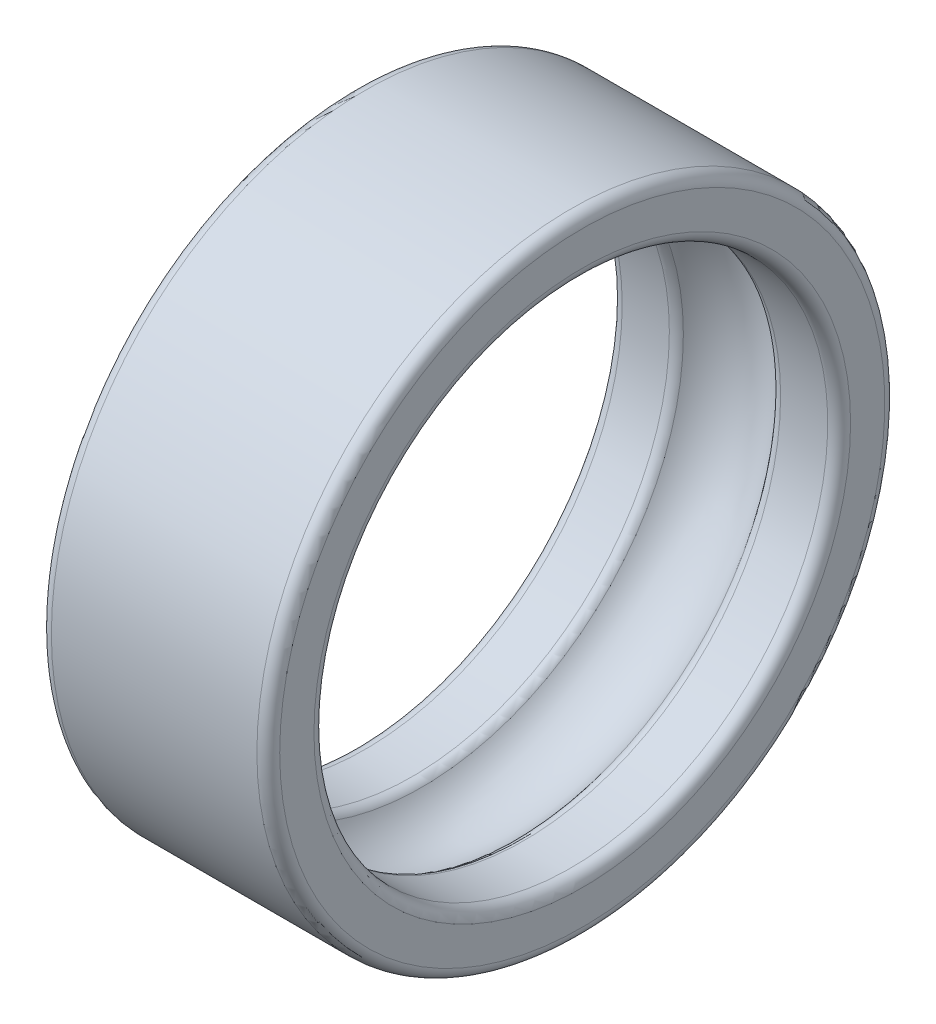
ISO-10303-21;
HEADER;
FILE_DESCRIPTION(('STEP AP214'),'2;1');
FILE_NAME('part.step','',(''),(''),'','','');
FILE_SCHEMA(('AUTOMOTIVE_DESIGN { 1 0 10303 214 1 1 1 1 }'));
ENDSEC;
DATA;
#1=APPLICATION_CONTEXT('core data for automotive mechanical design processes');
#2=APPLICATION_PROTOCOL_DEFINITION('international standard','automotive_design',2000,#1);
#3=PRODUCT_CONTEXT('',#1,'mechanical');
#4=PRODUCT('Part','Part','',(#3));
#5=PRODUCT_RELATED_PRODUCT_CATEGORY('part','',(#4));
#6=PRODUCT_DEFINITION_FORMATION('','',#4);
#7=PRODUCT_DEFINITION_CONTEXT('part definition',#1,'design');
#8=PRODUCT_DEFINITION('design','',#6,#7);
#9=PRODUCT_DEFINITION_SHAPE('','',#8);
#10=(LENGTH_UNIT() NAMED_UNIT(*) SI_UNIT(.MILLI.,.METRE.));
#11=(NAMED_UNIT(*) PLANE_ANGLE_UNIT() SI_UNIT($,.RADIAN.));
#12=(NAMED_UNIT(*) SI_UNIT($,.STERADIAN.) SOLID_ANGLE_UNIT());
#13=UNCERTAINTY_MEASURE_WITH_UNIT(LENGTH_MEASURE(1.E-05),#10,'distance_accuracy_value','');
#14=(GEOMETRIC_REPRESENTATION_CONTEXT(3) GLOBAL_UNCERTAINTY_ASSIGNED_CONTEXT((#13)) GLOBAL_UNIT_ASSIGNED_CONTEXT((#10,
#11,#12)) REPRESENTATION_CONTEXT('',''));
#15=CARTESIAN_POINT('',(0.,0.,0.));
#16=DIRECTION('',(0.,0.,1.));
#17=DIRECTION('',(1.,0.,0.));
#18=AXIS2_PLACEMENT_3D('',#15,#16,#17);
#19=CARTESIAN_POINT('',(-2.,5.5,0.));
#20=DIRECTION('',(1.,0.,0.));
#21=DIRECTION('',(0.,0.,-1.));
#22=AXIS2_PLACEMENT_3D('',#19,#20,#21);
#23=PLANE('',#22);
#24=CARTESIAN_POINT('',(-2.,0.,0.));
#25=DIRECTION('',(1.,0.,0.));
#26=DIRECTION('',(0.,0.,-1.));
#27=AXIS2_PLACEMENT_3D('',#24,#25,#26);
#28=CIRCLE('',#27,4.7);
#29=CARTESIAN_POINT('',(-2.,0.,-4.7));
#30=VERTEX_POINT('',#29);
#31=EDGE_CURVE('E38',#30,#30,#28,.T.);
#32=ORIENTED_EDGE('',*,*,#31,.T.);
#33=EDGE_LOOP('',(#32));
#34=FACE_BOUND('',#33,.T.);
#35=CARTESIAN_POINT('',(-2.,0.,0.));
#36=DIRECTION('',(1.,0.,0.));
#37=DIRECTION('',(0.,0.,-1.));
#38=AXIS2_PLACEMENT_3D('',#35,#36,#37);
#39=CIRCLE('',#38,5.3);
#40=CARTESIAN_POINT('',(-2.,0.,-5.3));
#41=VERTEX_POINT('',#40);
#42=EDGE_CURVE('E42',#41,#41,#39,.F.);
#43=ORIENTED_EDGE('',*,*,#42,.T.);
#44=EDGE_LOOP('',(#43));
#45=FACE_BOUND('',#44,.T.);
#46=ADVANCED_FACE('F28',(#34,#45),#23,.F.);
#47=CARTESIAN_POINT('',(0.,0.,0.));
#48=DIRECTION('',(-1.,0.,0.));
#49=DIRECTION('',(0.,0.,1.));
#50=AXIS2_PLACEMENT_3D('',#47,#48,#49);
#51=CYLINDRICAL_SURFACE('',#50,4.5);
#52=CARTESIAN_POINT('',(-1.8,0.,0.));
#53=DIRECTION('',(1.,0.,0.));
#54=DIRECTION('',(0.,0.,-1.));
#55=AXIS2_PLACEMENT_3D('',#52,#53,#54);
#56=CIRCLE('',#55,4.5);
#57=CARTESIAN_POINT('',(-1.8,0.,-4.5));
#58=VERTEX_POINT('',#57);
#59=EDGE_CURVE('E47',#58,#58,#56,.F.);
#60=ORIENTED_EDGE('',*,*,#59,.T.);
#61=EDGE_LOOP('',(#60));
#62=FACE_BOUND('',#61,.T.);
#63=CARTESIAN_POINT('',(-0.974679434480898,0.,0.));
#64=DIRECTION('',(1.,0.,0.));
#65=DIRECTION('',(0.,0.,-1.));
#66=AXIS2_PLACEMENT_3D('',#63,#64,#65);
#67=CIRCLE('',#66,4.5);
#68=CARTESIAN_POINT('',(-0.974679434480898,0.,-4.5));
#69=VERTEX_POINT('',#68);
#70=EDGE_CURVE('E50',#69,#69,#67,.T.);
#71=ORIENTED_EDGE('',*,*,#70,.T.);
#72=EDGE_LOOP('',(#71));
#73=FACE_BOUND('',#72,.T.);
#74=ADVANCED_FACE('F104',(#62,#73),#51,.F.);
#75=CARTESIAN_POINT('',(0.,0.,0.));
#76=DIRECTION('',(-1.,0.,0.));
#77=DIRECTION('',(0.,0.,1.));
#78=AXIS2_PLACEMENT_3D('',#75,#76,#77);
#79=TOROIDAL_SURFACE('',#78,4.,1.);
#80=CARTESIAN_POINT('',(0.812232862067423,0.,0.));
#81=DIRECTION('',(-1.,0.,0.));
#82=DIRECTION('',(0.,0.,1.));
#83=AXIS2_PLACEMENT_3D('',#80,#81,#82);
#84=CIRCLE('',#83,4.58333333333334);
#85=CARTESIAN_POINT('',(0.812232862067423,0.,4.58333333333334));
#86=VERTEX_POINT('',#85);
#87=EDGE_CURVE('E59',#86,#86,#84,.F.);
#88=ORIENTED_EDGE('',*,*,#87,.T.);
#89=EDGE_LOOP('',(#88));
#90=FACE_BOUND('',#89,.T.);
#91=CARTESIAN_POINT('',(-0.812232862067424,0.,0.));
#92=DIRECTION('',(1.,0.,0.));
#93=DIRECTION('',(0.,0.,-1.));
#94=AXIS2_PLACEMENT_3D('',#91,#92,#93);
#95=CIRCLE('',#94,4.58333333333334);
#96=CARTESIAN_POINT('',(-0.812232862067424,0.,-4.58333333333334));
#97=VERTEX_POINT('',#96);
#98=EDGE_CURVE('E62',#97,#97,#95,.F.);
#99=ORIENTED_EDGE('',*,*,#98,.T.);
#100=EDGE_LOOP('',(#99));
#101=FACE_BOUND('',#100,.T.);
#102=ADVANCED_FACE('F109',(#90,#101),#79,.F.);
#103=CARTESIAN_POINT('',(0.,0.,0.));
#104=DIRECTION('',(-1.,0.,0.));
#105=DIRECTION('',(0.,0.,1.));
#106=AXIS2_PLACEMENT_3D('',#103,#104,#105);
#107=CYLINDRICAL_SURFACE('',#106,4.5);
#108=CARTESIAN_POINT('',(0.974679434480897,0.,0.));
#109=DIRECTION('',(1.,0.,0.));
#110=DIRECTION('',(0.,0.,-1.));
#111=AXIS2_PLACEMENT_3D('',#108,#109,#110);
#112=CIRCLE('',#111,4.5);
#113=CARTESIAN_POINT('',(0.974679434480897,0.,-4.5));
#114=VERTEX_POINT('',#113);
#115=EDGE_CURVE('E65',#114,#114,#112,.F.);
#116=ORIENTED_EDGE('',*,*,#115,.T.);
#117=EDGE_LOOP('',(#116));
#118=FACE_BOUND('',#117,.T.);
#119=CARTESIAN_POINT('',(1.8,0.,0.));
#120=DIRECTION('',(-1.,0.,0.));
#121=DIRECTION('',(0.,0.,1.));
#122=AXIS2_PLACEMENT_3D('',#119,#120,#121);
#123=CIRCLE('',#122,4.5);
#124=CARTESIAN_POINT('',(1.8,0.,4.5));
#125=VERTEX_POINT('',#124);
#126=EDGE_CURVE('E68',#125,#125,#123,.F.);
#127=ORIENTED_EDGE('',*,*,#126,.T.);
#128=EDGE_LOOP('',(#127));
#129=FACE_BOUND('',#128,.T.);
#130=ADVANCED_FACE('F72',(#118,#129),#107,.F.);
#131=CARTESIAN_POINT('',(2.,5.5,0.));
#132=DIRECTION('',(-1.,0.,0.));
#133=DIRECTION('',(0.,0.,1.));
#134=AXIS2_PLACEMENT_3D('',#131,#132,#133);
#135=PLANE('',#134);
#136=CARTESIAN_POINT('',(2.,0.,0.));
#137=DIRECTION('',(-1.,0.,0.));
#138=DIRECTION('',(0.,0.,1.));
#139=AXIS2_PLACEMENT_3D('',#136,#137,#138);
#140=CIRCLE('',#139,4.7);
#141=CARTESIAN_POINT('',(2.,0.,4.7));
#142=VERTEX_POINT('',#141);
#143=EDGE_CURVE('E53',#142,#142,#140,.T.);
#144=ORIENTED_EDGE('',*,*,#143,.T.);
#145=EDGE_LOOP('',(#144));
#146=FACE_BOUND('',#145,.T.);
#147=CARTESIAN_POINT('',(2.,0.,0.));
#148=DIRECTION('',(-1.,0.,0.));
#149=DIRECTION('',(0.,0.,1.));
#150=AXIS2_PLACEMENT_3D('',#147,#148,#149);
#151=CIRCLE('',#150,5.3);
#152=CARTESIAN_POINT('',(2.,0.,5.3));
#153=VERTEX_POINT('',#152);
#154=EDGE_CURVE('E56',#153,#153,#151,.F.);
#155=ORIENTED_EDGE('',*,*,#154,.T.);
#156=EDGE_LOOP('',(#155));
#157=FACE_BOUND('',#156,.T.);
#158=ADVANCED_FACE('F82',(#146,#157),#135,.F.);
#159=CARTESIAN_POINT('',(0.,0.,0.));
#160=DIRECTION('',(-1.,0.,0.));
#161=DIRECTION('',(0.,0.,1.));
#162=AXIS2_PLACEMENT_3D('',#159,#160,#161);
#163=CYLINDRICAL_SURFACE('',#162,5.5);
#164=CARTESIAN_POINT('',(1.8,0.,0.));
#165=DIRECTION('',(-1.,0.,0.));
#166=DIRECTION('',(0.,0.,1.));
#167=AXIS2_PLACEMENT_3D('',#164,#165,#166);
#168=CIRCLE('',#167,5.5);
#169=CARTESIAN_POINT('',(1.8,0.,5.5));
#170=VERTEX_POINT('',#169);
#171=EDGE_CURVE('E10',#170,#170,#168,.T.);
#172=ORIENTED_EDGE('',*,*,#171,.T.);
#173=EDGE_LOOP('',(#172));
#174=FACE_BOUND('',#173,.T.);
#175=CARTESIAN_POINT('',(-1.8,0.,0.));
#176=DIRECTION('',(1.,0.,0.));
#177=DIRECTION('',(0.,0.,-1.));
#178=AXIS2_PLACEMENT_3D('',#175,#176,#177);
#179=CIRCLE('',#178,5.5);
#180=CARTESIAN_POINT('',(-1.8,0.,-5.5));
#181=VERTEX_POINT('',#180);
#182=EDGE_CURVE('E34',#181,#181,#179,.T.);
#183=ORIENTED_EDGE('',*,*,#182,.T.);
#184=EDGE_LOOP('',(#183));
#185=FACE_BOUND('',#184,.T.);
#186=ADVANCED_FACE('F85',(#174,#185),#163,.T.);
#187=CARTESIAN_POINT('',(0.974679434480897,0.,0.));
#188=DIRECTION('',(1.,0.,0.));
#189=DIRECTION('',(0.,0.,-1.));
#190=AXIS2_PLACEMENT_3D('',#187,#188,#189);
#191=TOROIDAL_SURFACE('',#190,4.7,0.2);
#192=ORIENTED_EDGE('',*,*,#87,.F.);
#193=EDGE_LOOP('',(#192));
#194=FACE_BOUND('',#193,.T.);
#195=ORIENTED_EDGE('',*,*,#115,.F.);
#196=EDGE_LOOP('',(#195));
#197=FACE_BOUND('',#196,.T.);
#198=ADVANCED_FACE('F78',(#194,#197),#191,.T.);
#199=CARTESIAN_POINT('',(1.8,0.,0.));
#200=DIRECTION('',(-1.,0.,0.));
#201=DIRECTION('',(0.,0.,1.));
#202=AXIS2_PLACEMENT_3D('',#199,#200,#201);
#203=TOROIDAL_SURFACE('',#202,4.7,0.2);
#204=ORIENTED_EDGE('',*,*,#126,.F.);
#205=EDGE_LOOP('',(#204));
#206=FACE_BOUND('',#205,.T.);
#207=ORIENTED_EDGE('',*,*,#143,.F.);
#208=EDGE_LOOP('',(#207));
#209=FACE_BOUND('',#208,.T.);
#210=ADVANCED_FACE('F74',(#206,#209),#203,.T.);
#211=CARTESIAN_POINT('',(-1.8,0.,0.));
#212=DIRECTION('',(1.,0.,0.));
#213=DIRECTION('',(0.,0.,-1.));
#214=AXIS2_PLACEMENT_3D('',#211,#212,#213);
#215=TOROIDAL_SURFACE('',#214,4.7,0.2);
#216=ORIENTED_EDGE('',*,*,#31,.F.);
#217=EDGE_LOOP('',(#216));
#218=FACE_BOUND('',#217,.T.);
#219=ORIENTED_EDGE('',*,*,#59,.F.);
#220=EDGE_LOOP('',(#219));
#221=FACE_BOUND('',#220,.T.);
#222=ADVANCED_FACE('F77',(#218,#221),#215,.T.);
#223=CARTESIAN_POINT('',(-0.974679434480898,0.,0.));
#224=DIRECTION('',(1.,0.,0.));
#225=DIRECTION('',(0.,0.,-1.));
#226=AXIS2_PLACEMENT_3D('',#223,#224,#225);
#227=TOROIDAL_SURFACE('',#226,4.7,0.2);
#228=ORIENTED_EDGE('',*,*,#70,.F.);
#229=EDGE_LOOP('',(#228));
#230=FACE_BOUND('',#229,.T.);
#231=ORIENTED_EDGE('',*,*,#98,.F.);
#232=EDGE_LOOP('',(#231));
#233=FACE_BOUND('',#232,.T.);
#234=ADVANCED_FACE('F93',(#230,#233),#227,.T.);
#235=CARTESIAN_POINT('',(1.8,0.,0.));
#236=DIRECTION('',(-1.,0.,0.));
#237=DIRECTION('',(0.,0.,1.));
#238=AXIS2_PLACEMENT_3D('',#235,#236,#237);
#239=TOROIDAL_SURFACE('',#238,5.3,0.2);
#240=ORIENTED_EDGE('',*,*,#154,.F.);
#241=EDGE_LOOP('',(#240));
#242=FACE_BOUND('',#241,.T.);
#243=ORIENTED_EDGE('',*,*,#171,.F.);
#244=EDGE_LOOP('',(#243));
#245=FACE_BOUND('',#244,.T.);
#246=ADVANCED_FACE('F89',(#242,#245),#239,.T.);
#247=CARTESIAN_POINT('',(-1.8,0.,0.));
#248=DIRECTION('',(1.,0.,0.));
#249=DIRECTION('',(0.,0.,-1.));
#250=AXIS2_PLACEMENT_3D('',#247,#248,#249);
#251=TOROIDAL_SURFACE('',#250,5.3,0.2);
#252=ORIENTED_EDGE('',*,*,#182,.F.);
#253=EDGE_LOOP('',(#252));
#254=FACE_BOUND('',#253,.T.);
#255=ORIENTED_EDGE('',*,*,#42,.F.);
#256=EDGE_LOOP('',(#255));
#257=FACE_BOUND('',#256,.T.);
#258=ADVANCED_FACE('F92',(#254,#257),#251,.T.);
#259=CLOSED_SHELL('',(#46,#74,#102,#130,#158,#186,#198,#210,#222,#234,#246,#258));
#260=MANIFOLD_SOLID_BREP('B2',#259);
#261=ADVANCED_BREP_SHAPE_REPRESENTATION('',(#18,#260),#14);
#262=SHAPE_DEFINITION_REPRESENTATION(#9,#261);
ENDSEC;
END-ISO-10303-21;
